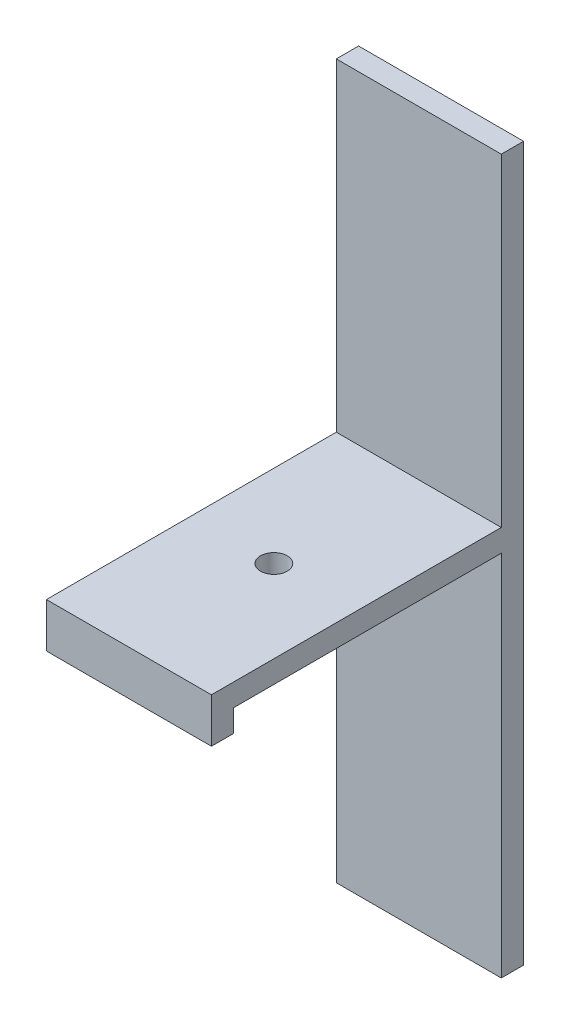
from build123d import *

# Parameters (mm, degrees)
SKETCH1_W           = 37
SKETCH1_H           = 160
BOSS_EXTRUDE1_DEPTH = 5
SKETCH2_W           = 37
SKETCH2_H           = 5
BOSS_EXTRUDE2_DEPTH = 65
SKETCH3_R           = 3
CUT_EXTRUDE1_DEPTH  = 30
SKETCH5_W           = 37
SKETCH5_H           = 5
BOSS_EXTRUDE4_DEPTH = 5


with BuildPart() as part:
    # Sketch1 → Boss-Extrude1 (new body)
    with BuildSketch(Plane.XY):
        with Locations((-18.5, -5)):
            Rectangle(SKETCH1_W, SKETCH1_H)
    extrude(amount=BOSS_EXTRUDE1_DEPTH)

    # Sketch2 → Boss-Extrude2 (add)
    with BuildSketch(Plane.XY.offset(5)):
        with Locations((-18.5, 0)):
            Rectangle(SKETCH2_W, SKETCH2_H)
    extrude(amount=BOSS_EXTRUDE2_DEPTH)

    # Sketch3 → Cut-Extrude1 (cut)
    with BuildSketch(Plane(origin=(0, 2.5, 0), x_dir=(1, 0, 0), z_dir=(0, 1, 0))):
        with Locations(Location((-18.5, -37.5, 0), (0, 0, 270))):
            Circle(SKETCH3_R)
    extrude(amount=-CUT_EXTRUDE1_DEPTH, mode=Mode.SUBTRACT)

    # Sketch5 → Boss-Extrude4 (add)
    with BuildSketch(Plane.XZ.offset(2.5)):
        with Locations((-18.5, 67.5)):
            Rectangle(SKETCH5_W, SKETCH5_H)
    extrude(amount=BOSS_EXTRUDE4_DEPTH)


solid = part.part
